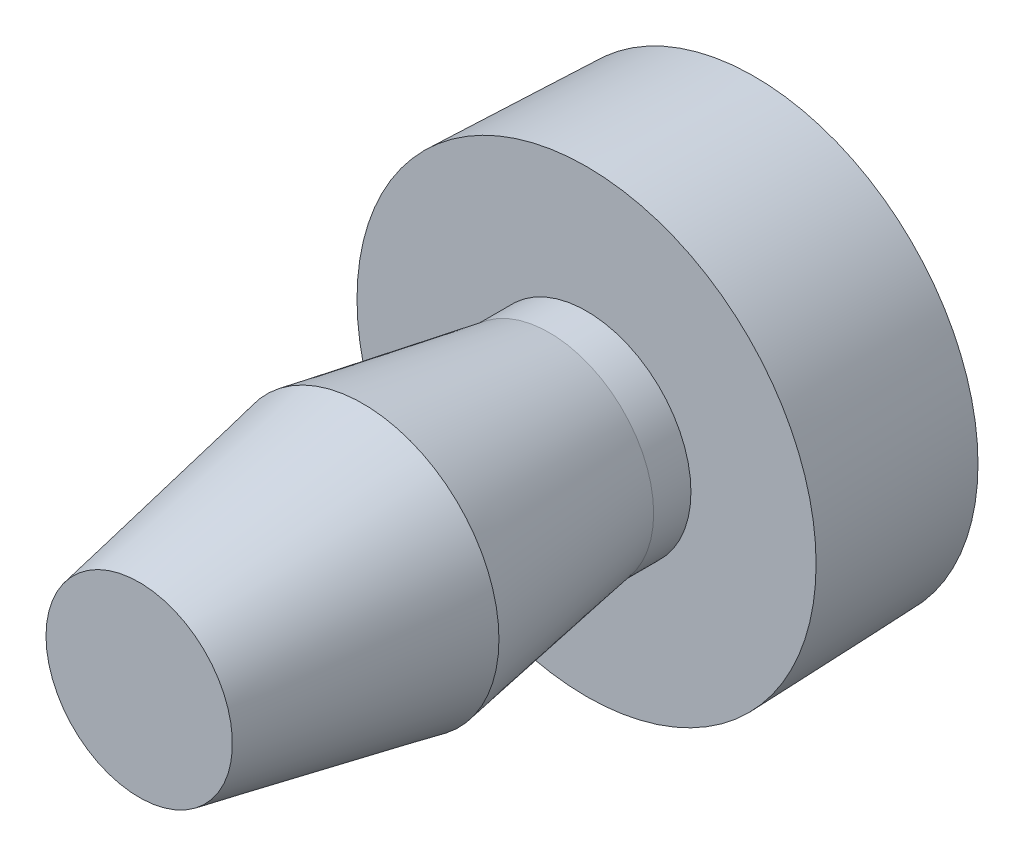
ISO-10303-21;
HEADER;
FILE_DESCRIPTION(('STEP AP214'),'2;1');
FILE_NAME('part.step','',(''),(''),'','','');
FILE_SCHEMA(('AUTOMOTIVE_DESIGN { 1 0 10303 214 1 1 1 1 }'));
ENDSEC;
DATA;
#1=APPLICATION_CONTEXT('core data for automotive mechanical design processes');
#2=APPLICATION_PROTOCOL_DEFINITION('international standard','automotive_design',2000,#1);
#3=PRODUCT_CONTEXT('',#1,'mechanical');
#4=PRODUCT('Part','Part','',(#3));
#5=PRODUCT_RELATED_PRODUCT_CATEGORY('part','',(#4));
#6=PRODUCT_DEFINITION_FORMATION('','',#4);
#7=PRODUCT_DEFINITION_CONTEXT('part definition',#1,'design');
#8=PRODUCT_DEFINITION('design','',#6,#7);
#9=PRODUCT_DEFINITION_SHAPE('','',#8);
#10=(LENGTH_UNIT() NAMED_UNIT(*) SI_UNIT(.MILLI.,.METRE.));
#11=(NAMED_UNIT(*) PLANE_ANGLE_UNIT() SI_UNIT($,.RADIAN.));
#12=(NAMED_UNIT(*) SI_UNIT($,.STERADIAN.) SOLID_ANGLE_UNIT());
#13=UNCERTAINTY_MEASURE_WITH_UNIT(LENGTH_MEASURE(1.E-05),#10,'distance_accuracy_value','');
#14=(GEOMETRIC_REPRESENTATION_CONTEXT(3) GLOBAL_UNCERTAINTY_ASSIGNED_CONTEXT((#13)) GLOBAL_UNIT_ASSIGNED_CONTEXT((#10,
#11,#12)) REPRESENTATION_CONTEXT('',''));
#15=CARTESIAN_POINT('',(0.,0.,0.));
#16=DIRECTION('',(0.,0.,1.));
#17=DIRECTION('',(1.,0.,0.));
#18=AXIS2_PLACEMENT_3D('',#15,#16,#17);
#19=CARTESIAN_POINT('',(-4.44089209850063E-13,2.50000000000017,16.4999999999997));
#20=DIRECTION('',(0.,0.,1.));
#21=DIRECTION('',(1.,0.,0.));
#22=AXIS2_PLACEMENT_3D('',#19,#20,#21);
#23=PLANE('',#22);
#24=CARTESIAN_POINT('',(0.,1.11022302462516E-13,16.5000000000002));
#25=DIRECTION('',(0.,0.,-1.));
#26=DIRECTION('',(-1.,0.,0.));
#27=AXIS2_PLACEMENT_3D('',#24,#25,#26);
#28=CIRCLE('',#27,2.5);
#29=CARTESIAN_POINT('',(-2.5,1.10744746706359E-13,16.5000000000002));
#30=VERTEX_POINT('',#29);
#31=EDGE_CURVE('E49',#30,#30,#28,.T.);
#32=ORIENTED_EDGE('',*,*,#31,.F.);
#33=EDGE_LOOP('',(#32));
#34=FACE_BOUND('',#33,.T.);
#35=ADVANCED_FACE('F34',(#34),#23,.T.);
#36=CARTESIAN_POINT('',(-1.11022302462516E-13,1.11022302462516E-13,10.4999999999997));
#37=DIRECTION('',(0.,0.,-1.));
#38=DIRECTION('',(-1.,0.,0.));
#39=AXIS2_PLACEMENT_3D('',#36,#37,#38);
#40=CONICAL_SURFACE('',#39,3.65,0.189370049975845);
#41=ORIENTED_EDGE('',*,*,#31,.T.);
#42=EDGE_LOOP('',(#41));
#43=FACE_BOUND('',#42,.T.);
#44=CARTESIAN_POINT('',(-1.11022302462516E-13,1.11022302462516E-13,10.4999999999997));
#45=DIRECTION('',(0.,0.,-1.));
#46=DIRECTION('',(-1.,0.,0.));
#47=AXIS2_PLACEMENT_3D('',#44,#45,#46);
#48=CIRCLE('',#47,3.65);
#49=CARTESIAN_POINT('',(-3.65000000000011,1.10617071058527E-13,10.4999999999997));
#50=VERTEX_POINT('',#49);
#51=EDGE_CURVE('E54',#50,#50,#48,.T.);
#52=ORIENTED_EDGE('',*,*,#51,.F.);
#53=EDGE_LOOP('',(#52));
#54=FACE_BOUND('',#53,.T.);
#55=ADVANCED_FACE('F65',(#43,#54),#40,.T.);
#56=CARTESIAN_POINT('',(0.,1.11022302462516E-13,5.49999999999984));
#57=DIRECTION('',(0.,0.,1.));
#58=DIRECTION('',(1.,0.,0.));
#59=AXIS2_PLACEMENT_3D('',#56,#57,#58);
#60=CONICAL_SURFACE('',#59,2.8,0.16839015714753);
#61=ORIENTED_EDGE('',*,*,#51,.T.);
#62=EDGE_LOOP('',(#61));
#63=FACE_BOUND('',#62,.T.);
#64=CARTESIAN_POINT('',(0.,1.11022302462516E-13,5.49999999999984));
#65=DIRECTION('',(0.,0.,-1.));
#66=DIRECTION('',(-1.,0.,0.));
#67=AXIS2_PLACEMENT_3D('',#64,#65,#66);
#68=CIRCLE('',#67,2.8);
#69=CARTESIAN_POINT('',(-2.8,1.10711440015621E-13,5.49999999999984));
#70=VERTEX_POINT('',#69);
#71=EDGE_CURVE('E57',#70,#70,#68,.T.);
#72=ORIENTED_EDGE('',*,*,#71,.F.);
#73=EDGE_LOOP('',(#72));
#74=FACE_BOUND('',#73,.T.);
#75=ADVANCED_FACE('F63',(#63,#74),#60,.T.);
#76=CARTESIAN_POINT('',(-1.11022302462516E-13,1.11022302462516E-13,1.9641102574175));
#77=DIRECTION('',(0.,0.,-1.));
#78=DIRECTION('',(-1.,0.,0.));
#79=AXIS2_PLACEMENT_3D('',#76,#77,#78);
#80=CYLINDRICAL_SURFACE('',#79,2.8);
#81=ORIENTED_EDGE('',*,*,#71,.T.);
#82=EDGE_LOOP('',(#81));
#83=FACE_BOUND('',#82,.T.);
#84=CARTESIAN_POINT('',(0.,2.22044604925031E-13,4.49999999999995));
#85=DIRECTION('',(0.,0.,1.));
#86=DIRECTION('',(1.,0.,0.));
#87=AXIS2_PLACEMENT_3D('',#84,#85,#86);
#88=CIRCLE('',#87,2.8);
#89=CARTESIAN_POINT('',(2.8,2.22355467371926E-13,4.49999999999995));
#90=VERTEX_POINT('',#89);
#91=EDGE_CURVE('E10',#90,#90,#88,.T.);
#92=ORIENTED_EDGE('',*,*,#91,.T.);
#93=EDGE_LOOP('',(#92));
#94=FACE_BOUND('',#93,.T.);
#95=ADVANCED_FACE('F61',(#83,#94),#80,.T.);
#96=CARTESIAN_POINT('',(0.,-1.11022302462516E-13,0.));
#97=DIRECTION('',(0.,0.,1.));
#98=DIRECTION('',(1.,0.,0.));
#99=AXIS2_PLACEMENT_3D('',#96,#97,#98);
#100=CONICAL_SURFACE('',#99,6.,0.0349065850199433);
#101=CARTESIAN_POINT('',(0.,2.22044604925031E-13,4.49999999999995));
#102=DIRECTION('',(0.,0.,1.));
#103=DIRECTION('',(1.,0.,0.));
#104=AXIS2_PLACEMENT_3D('',#101,#102,#103);
#105=CIRCLE('',#104,6.15714346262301);
#106=CARTESIAN_POINT('',(6.15714346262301,2.22728185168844E-13,4.49999999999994));
#107=VERTEX_POINT('',#106);
#108=EDGE_CURVE('E41',#107,#107,#105,.T.);
#109=ORIENTED_EDGE('',*,*,#108,.F.);
#110=EDGE_LOOP('',(#109));
#111=FACE_BOUND('',#110,.T.);
#112=CARTESIAN_POINT('',(0.,-1.11022302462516E-13,0.));
#113=DIRECTION('',(0.,0.,1.));
#114=DIRECTION('',(1.,0.,0.));
#115=AXIS2_PLACEMENT_3D('',#112,#113,#114);
#116=CIRCLE('',#115,6.);
#117=CARTESIAN_POINT('',(6.,-1.10356168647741E-13,0.));
#118=VERTEX_POINT('',#117);
#119=EDGE_CURVE('E45',#118,#118,#116,.T.);
#120=ORIENTED_EDGE('',*,*,#119,.T.);
#121=EDGE_LOOP('',(#120));
#122=FACE_BOUND('',#121,.T.);
#123=ADVANCED_FACE('F36',(#111,#122),#100,.T.);
#124=CARTESIAN_POINT('',(0.,2.22044604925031E-13,4.49999999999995));
#125=DIRECTION('',(0.,0.,1.));
#126=DIRECTION('',(1.,0.,0.));
#127=AXIS2_PLACEMENT_3D('',#124,#125,#126);
#128=PLANE('',#127);
#129=ORIENTED_EDGE('',*,*,#91,.F.);
#130=EDGE_LOOP('',(#129));
#131=FACE_BOUND('',#130,.T.);
#132=ORIENTED_EDGE('',*,*,#108,.T.);
#133=EDGE_LOOP('',(#132));
#134=FACE_BOUND('',#133,.T.);
#135=ADVANCED_FACE('F73',(#131,#134),#128,.T.);
#136=CARTESIAN_POINT('',(0.,-1.11022302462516E-13,0.));
#137=DIRECTION('',(0.,0.,1.));
#138=DIRECTION('',(1.,0.,0.));
#139=AXIS2_PLACEMENT_3D('',#136,#137,#138);
#140=PLANE('',#139);
#141=ORIENTED_EDGE('',*,*,#119,.F.);
#142=EDGE_LOOP('',(#141));
#143=FACE_BOUND('',#142,.T.);
#144=ADVANCED_FACE('F83',(#143),#140,.F.);
#145=CLOSED_SHELL('',(#35,#55,#75,#95,#123,#135,#144));
#146=MANIFOLD_SOLID_BREP('B2',#145);
#147=ADVANCED_BREP_SHAPE_REPRESENTATION('',(#18,#146),#14);
#148=SHAPE_DEFINITION_REPRESENTATION(#9,#147);
ENDSEC;
END-ISO-10303-21;
